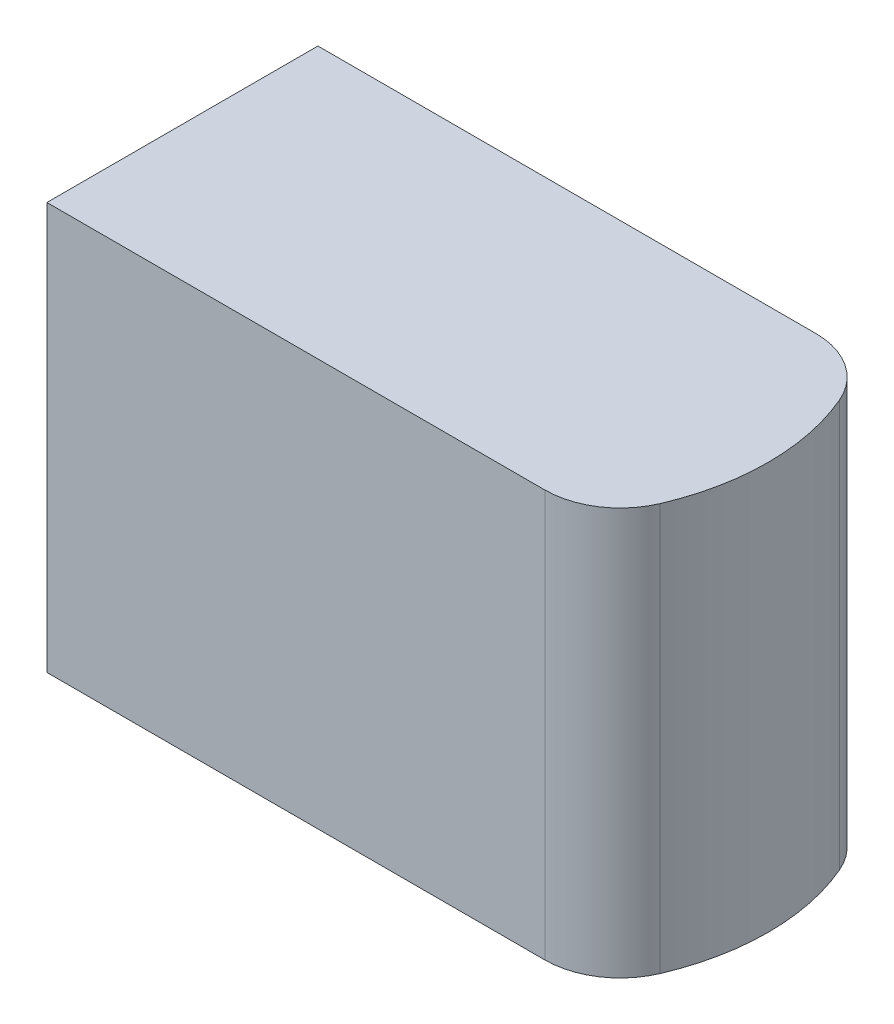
ISO-10303-21;
HEADER;
FILE_DESCRIPTION(('STEP AP214'),'2;1');
FILE_NAME('part.step','',(''),(''),'','','');
FILE_SCHEMA(('AUTOMOTIVE_DESIGN { 1 0 10303 214 1 1 1 1 }'));
ENDSEC;
DATA;
#1=APPLICATION_CONTEXT('core data for automotive mechanical design processes');
#2=APPLICATION_PROTOCOL_DEFINITION('international standard','automotive_design',2000,#1);
#3=PRODUCT_CONTEXT('',#1,'mechanical');
#4=PRODUCT('Part','Part','',(#3));
#5=PRODUCT_RELATED_PRODUCT_CATEGORY('part','',(#4));
#6=PRODUCT_DEFINITION_FORMATION('','',#4);
#7=PRODUCT_DEFINITION_CONTEXT('part definition',#1,'design');
#8=PRODUCT_DEFINITION('design','',#6,#7);
#9=PRODUCT_DEFINITION_SHAPE('','',#8);
#10=(LENGTH_UNIT() NAMED_UNIT(*) SI_UNIT(.MILLI.,.METRE.));
#11=(NAMED_UNIT(*) PLANE_ANGLE_UNIT() SI_UNIT($,.RADIAN.));
#12=(NAMED_UNIT(*) SI_UNIT($,.STERADIAN.) SOLID_ANGLE_UNIT());
#13=UNCERTAINTY_MEASURE_WITH_UNIT(LENGTH_MEASURE(1.E-05),#10,'distance_accuracy_value','');
#14=(GEOMETRIC_REPRESENTATION_CONTEXT(3) GLOBAL_UNCERTAINTY_ASSIGNED_CONTEXT((#13)) GLOBAL_UNIT_ASSIGNED_CONTEXT((#10,
#11,#12)) REPRESENTATION_CONTEXT('',''));
#15=CARTESIAN_POINT('',(0.,0.,0.));
#16=DIRECTION('',(0.,0.,1.));
#17=DIRECTION('',(1.,0.,0.));
#18=AXIS2_PLACEMENT_3D('',#15,#16,#17);
#19=CARTESIAN_POINT('',(3.4161832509,4.965,-19.645));
#20=DIRECTION('',(0.,1.,0.));
#21=DIRECTION('',(0.,0.,1.));
#22=AXIS2_PLACEMENT_3D('',#19,#20,#21);
#23=CYLINDRICAL_SURFACE('',#22,0.76);
#24=DIRECTION('',(0.,1.,0.));
#25=VECTOR('',#24,1.);
#26=CARTESIAN_POINT('',(4.11507888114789,4.965,-19.3464285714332));
#27=LINE('',#26,#25);
#28=CARTESIAN_POINT('',(4.11507888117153,7.015,-19.346428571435));
#29=VERTEX_POINT('',#28);
#30=CARTESIAN_POINT('',(4.11507888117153,2.915,-19.346428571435));
#31=VERTEX_POINT('',#30);
#32=EDGE_CURVE('E87',#29,#31,#27,.F.);
#33=ORIENTED_EDGE('',*,*,#32,.F.);
#34=CARTESIAN_POINT('',(3.4161832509,7.015,-19.645));
#35=DIRECTION('',(0.,1.,0.));
#36=DIRECTION('',(0.,0.,1.));
#37=AXIS2_PLACEMENT_3D('',#34,#35,#36);
#38=CIRCLE('',#37,0.76);
#39=CARTESIAN_POINT('',(3.4161832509,7.015,-18.885));
#40=VERTEX_POINT('',#39);
#41=EDGE_CURVE('E80',#29,#40,#38,.F.);
#42=ORIENTED_EDGE('',*,*,#41,.T.);
#43=DIRECTION('',(0.,1.,0.));
#44=VECTOR('',#43,1.);
#45=CARTESIAN_POINT('',(3.4161832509,7.015,-18.885));
#46=LINE('',#45,#44);
#47=CARTESIAN_POINT('',(3.4161832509,2.915,-18.885));
#48=VERTEX_POINT('',#47);
#49=EDGE_CURVE('E82',#48,#40,#46,.T.);
#50=ORIENTED_EDGE('',*,*,#49,.F.);
#51=CARTESIAN_POINT('',(3.4161832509,2.915,-19.645));
#52=DIRECTION('',(0.,1.,0.));
#53=DIRECTION('',(0.,0.,1.));
#54=AXIS2_PLACEMENT_3D('',#51,#52,#53);
#55=CIRCLE('',#54,0.76);
#56=EDGE_CURVE('E21',#48,#31,#55,.T.);
#57=ORIENTED_EDGE('',*,*,#56,.T.);
#58=EDGE_LOOP('',(#33,#42,#50,#57));
#59=FACE_BOUND('',#58,.T.);
#60=ADVANCED_FACE('F18',(#59),#23,.T.);
#61=CARTESIAN_POINT('',(2.,4.965,-20.25));
#62=DIRECTION('',(0.,1.,0.));
#63=DIRECTION('',(0.,0.,1.));
#64=AXIS2_PLACEMENT_3D('',#61,#62,#63);
#65=CYLINDRICAL_SURFACE('',#64,2.3);
#66=DIRECTION('',(0.,1.,0.));
#67=VECTOR('',#66,1.);
#68=CARTESIAN_POINT('',(4.11507888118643,4.965,-21.1535714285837));
#69=LINE('',#68,#67);
#70=CARTESIAN_POINT('',(4.11507888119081,7.015,-21.1535714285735));
#71=VERTEX_POINT('',#70);
#72=CARTESIAN_POINT('',(4.11507888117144,2.915,-21.1535714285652));
#73=VERTEX_POINT('',#72);
#74=EDGE_CURVE('E86',#71,#73,#69,.F.);
#75=ORIENTED_EDGE('',*,*,#74,.F.);
#76=CARTESIAN_POINT('',(2.,7.015,-20.25));
#77=DIRECTION('',(0.,1.,0.));
#78=DIRECTION('',(0.,0.,1.));
#79=AXIS2_PLACEMENT_3D('',#76,#77,#78);
#80=CIRCLE('',#79,2.3);
#81=EDGE_CURVE('E106',#71,#29,#80,.F.);
#82=ORIENTED_EDGE('',*,*,#81,.T.);
#83=ORIENTED_EDGE('',*,*,#32,.T.);
#84=CARTESIAN_POINT('',(2.,2.915,-20.25));
#85=DIRECTION('',(0.,1.,0.));
#86=DIRECTION('',(0.,0.,1.));
#87=AXIS2_PLACEMENT_3D('',#84,#85,#86);
#88=CIRCLE('',#87,2.3);
#89=EDGE_CURVE('E76',#73,#31,#88,.F.);
#90=ORIENTED_EDGE('',*,*,#89,.F.);
#91=EDGE_LOOP('',(#75,#82,#83,#90));
#92=FACE_BOUND('',#91,.T.);
#93=ADVANCED_FACE('F144',(#92),#65,.T.);
#94=CARTESIAN_POINT('',(3.4161832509,7.015,-18.885));
#95=DIRECTION('',(0.,0.,1.));
#96=DIRECTION('',(1.,0.,0.));
#97=AXIS2_PLACEMENT_3D('',#94,#95,#96);
#98=PLANE('',#97);
#99=ORIENTED_EDGE('',*,*,#49,.T.);
#100=DIRECTION('',(1.,0.,0.));
#101=VECTOR('',#100,1.);
#102=CARTESIAN_POINT('',(-7.54,7.015,-18.885));
#103=LINE('',#102,#101);
#104=CARTESIAN_POINT('',(-1.6,7.015,-18.885));
#105=VERTEX_POINT('',#104);
#106=EDGE_CURVE('E109',#40,#105,#103,.F.);
#107=ORIENTED_EDGE('',*,*,#106,.T.);
#108=DIRECTION('',(0.,1.,0.));
#109=VECTOR('',#108,1.);
#110=CARTESIAN_POINT('',(-1.6,7.015,-18.885));
#111=LINE('',#110,#109);
#112=CARTESIAN_POINT('',(-1.6,2.915,-18.885));
#113=VERTEX_POINT('',#112);
#114=EDGE_CURVE('E90',#105,#113,#111,.F.);
#115=ORIENTED_EDGE('',*,*,#114,.T.);
#116=DIRECTION('',(1.,0.,0.));
#117=VECTOR('',#116,1.);
#118=CARTESIAN_POINT('',(-7.54,2.915,-18.885));
#119=LINE('',#118,#117);
#120=EDGE_CURVE('E72',#48,#113,#119,.F.);
#121=ORIENTED_EDGE('',*,*,#120,.F.);
#122=EDGE_LOOP('',(#99,#107,#115,#121));
#123=FACE_BOUND('',#122,.T.);
#124=ADVANCED_FACE('F89',(#123),#98,.T.);
#125=CARTESIAN_POINT('',(3.4161832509,4.965,-20.855));
#126=DIRECTION('',(0.,1.,0.));
#127=DIRECTION('',(0.,0.,1.));
#128=AXIS2_PLACEMENT_3D('',#125,#126,#127);
#129=CYLINDRICAL_SURFACE('',#128,0.76);
#130=DIRECTION('',(0.,1.,0.));
#131=VECTOR('',#130,1.);
#132=CARTESIAN_POINT('',(3.4161832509,7.015,-21.615));
#133=LINE('',#132,#131);
#134=CARTESIAN_POINT('',(3.4161832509,7.015,-21.615));
#135=VERTEX_POINT('',#134);
#136=CARTESIAN_POINT('',(3.4161832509,2.915,-21.615));
#137=VERTEX_POINT('',#136);
#138=EDGE_CURVE('E130',#135,#137,#133,.F.);
#139=ORIENTED_EDGE('',*,*,#138,.F.);
#140=CARTESIAN_POINT('',(3.4161832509,7.015,-20.855));
#141=DIRECTION('',(0.,1.,0.));
#142=DIRECTION('',(0.,0.,1.));
#143=AXIS2_PLACEMENT_3D('',#140,#141,#142);
#144=CIRCLE('',#143,0.76);
#145=EDGE_CURVE('E110',#135,#71,#144,.F.);
#146=ORIENTED_EDGE('',*,*,#145,.T.);
#147=ORIENTED_EDGE('',*,*,#74,.T.);
#148=CARTESIAN_POINT('',(3.4161832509,2.915,-20.855));
#149=DIRECTION('',(0.,1.,0.));
#150=DIRECTION('',(0.,0.,1.));
#151=AXIS2_PLACEMENT_3D('',#148,#149,#150);
#152=CIRCLE('',#151,0.76);
#153=EDGE_CURVE('E91',#137,#73,#152,.F.);
#154=ORIENTED_EDGE('',*,*,#153,.F.);
#155=EDGE_LOOP('',(#139,#146,#147,#154));
#156=FACE_BOUND('',#155,.T.);
#157=ADVANCED_FACE('F142',(#156),#129,.T.);
#158=CARTESIAN_POINT('',(-7.54,2.915,-21.615));
#159=DIRECTION('',(0.,-1.,0.));
#160=DIRECTION('',(0.,0.,-1.));
#161=AXIS2_PLACEMENT_3D('',#158,#159,#160);
#162=PLANE('',#161);
#163=ORIENTED_EDGE('',*,*,#89,.T.);
#164=ORIENTED_EDGE('',*,*,#56,.F.);
#165=ORIENTED_EDGE('',*,*,#120,.T.);
#166=DIRECTION('',(0.,0.,-1.));
#167=VECTOR('',#166,1.);
#168=CARTESIAN_POINT('',(-1.6,2.915,-21.615));
#169=LINE('',#168,#167);
#170=CARTESIAN_POINT('',(-1.6,2.915,-21.615));
#171=VERTEX_POINT('',#170);
#172=EDGE_CURVE('E103',#113,#171,#169,.T.);
#173=ORIENTED_EDGE('',*,*,#172,.T.);
#174=DIRECTION('',(-1.,0.,0.));
#175=VECTOR('',#174,1.);
#176=CARTESIAN_POINT('',(-1.6,2.915,-21.615));
#177=LINE('',#176,#175);
#178=EDGE_CURVE('E125',#137,#171,#177,.T.);
#179=ORIENTED_EDGE('',*,*,#178,.F.);
#180=ORIENTED_EDGE('',*,*,#153,.T.);
#181=EDGE_LOOP('',(#163,#164,#165,#173,#179,#180));
#182=FACE_BOUND('',#181,.T.);
#183=ADVANCED_FACE('F70',(#182),#162,.T.);
#184=CARTESIAN_POINT('',(-1.6,7.015,-21.615));
#185=DIRECTION('',(1.,0.,0.));
#186=DIRECTION('',(0.,0.,-1.));
#187=AXIS2_PLACEMENT_3D('',#184,#185,#186);
#188=PLANE('',#187);
#189=DIRECTION('',(0.,1.,0.));
#190=VECTOR('',#189,1.);
#191=CARTESIAN_POINT('',(-1.6,7.015,-21.615));
#192=LINE('',#191,#190);
#193=CARTESIAN_POINT('',(-1.6,7.015,-21.615));
#194=VERTEX_POINT('',#193);
#195=EDGE_CURVE('E27',#171,#194,#192,.T.);
#196=ORIENTED_EDGE('',*,*,#195,.F.);
#197=ORIENTED_EDGE('',*,*,#172,.F.);
#198=ORIENTED_EDGE('',*,*,#114,.F.);
#199=DIRECTION('',(0.,0.,-1.));
#200=VECTOR('',#199,1.);
#201=CARTESIAN_POINT('',(-1.6,7.015,-21.615));
#202=LINE('',#201,#200);
#203=EDGE_CURVE('E36',#105,#194,#202,.T.);
#204=ORIENTED_EDGE('',*,*,#203,.T.);
#205=EDGE_LOOP('',(#196,#197,#198,#204));
#206=FACE_BOUND('',#205,.T.);
#207=ADVANCED_FACE('F141',(#206),#188,.F.);
#208=CARTESIAN_POINT('',(-7.54,7.015,-21.615));
#209=DIRECTION('',(0.,-1.,0.));
#210=DIRECTION('',(0.,0.,-1.));
#211=AXIS2_PLACEMENT_3D('',#208,#209,#210);
#212=PLANE('',#211);
#213=ORIENTED_EDGE('',*,*,#41,.F.);
#214=ORIENTED_EDGE('',*,*,#81,.F.);
#215=ORIENTED_EDGE('',*,*,#145,.F.);
#216=DIRECTION('',(-1.,0.,0.));
#217=VECTOR('',#216,1.);
#218=CARTESIAN_POINT('',(-1.6,7.015,-21.615));
#219=LINE('',#218,#217);
#220=EDGE_CURVE('E11',#194,#135,#219,.F.);
#221=ORIENTED_EDGE('',*,*,#220,.F.);
#222=ORIENTED_EDGE('',*,*,#203,.F.);
#223=ORIENTED_EDGE('',*,*,#106,.F.);
#224=EDGE_LOOP('',(#213,#214,#215,#221,#222,#223));
#225=FACE_BOUND('',#224,.T.);
#226=ADVANCED_FACE('F139',(#225),#212,.F.);
#227=CARTESIAN_POINT('',(-1.6,7.015,-21.615));
#228=DIRECTION('',(0.,0.,-1.));
#229=DIRECTION('',(-1.,0.,0.));
#230=AXIS2_PLACEMENT_3D('',#227,#228,#229);
#231=PLANE('',#230);
#232=ORIENTED_EDGE('',*,*,#195,.T.);
#233=ORIENTED_EDGE('',*,*,#220,.T.);
#234=ORIENTED_EDGE('',*,*,#138,.T.);
#235=ORIENTED_EDGE('',*,*,#178,.T.);
#236=EDGE_LOOP('',(#232,#233,#234,#235));
#237=FACE_BOUND('',#236,.T.);
#238=ADVANCED_FACE('F140',(#237),#231,.T.);
#239=CLOSED_SHELL('',(#60,#93,#124,#157,#183,#207,#226,#238));
#240=MANIFOLD_SOLID_BREP('B1',#239);
#241=ADVANCED_BREP_SHAPE_REPRESENTATION('',(#18,#240),#14);
#242=SHAPE_DEFINITION_REPRESENTATION(#9,#241);
ENDSEC;
END-ISO-10303-21;
